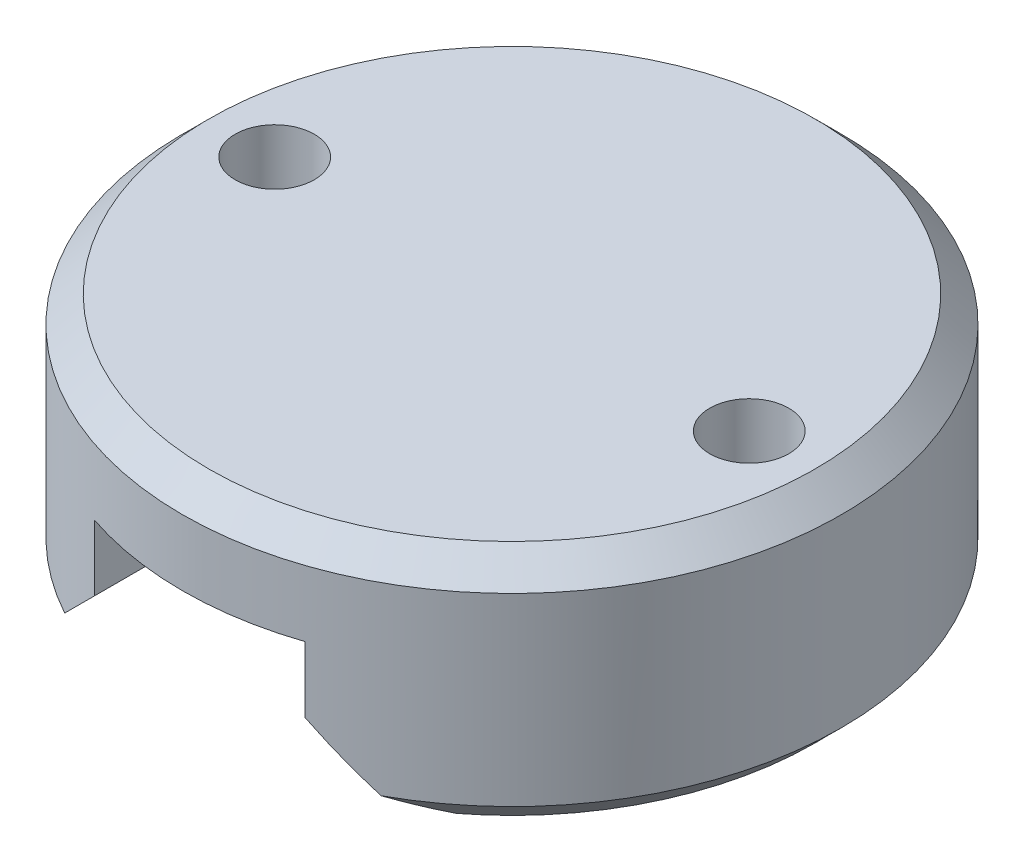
ISO-10303-21;
HEADER;
FILE_DESCRIPTION(('STEP AP214'),'2;1');
FILE_NAME('part.step','',(''),(''),'','','');
FILE_SCHEMA(('AUTOMOTIVE_DESIGN { 1 0 10303 214 1 1 1 1 }'));
ENDSEC;
DATA;
#1=APPLICATION_CONTEXT('core data for automotive mechanical design processes');
#2=APPLICATION_PROTOCOL_DEFINITION('international standard','automotive_design',2000,#1);
#3=PRODUCT_CONTEXT('',#1,'mechanical');
#4=PRODUCT('Part','Part','',(#3));
#5=PRODUCT_RELATED_PRODUCT_CATEGORY('part','',(#4));
#6=PRODUCT_DEFINITION_FORMATION('','',#4);
#7=PRODUCT_DEFINITION_CONTEXT('part definition',#1,'design');
#8=PRODUCT_DEFINITION('design','',#6,#7);
#9=PRODUCT_DEFINITION_SHAPE('','',#8);
#10=(LENGTH_UNIT() NAMED_UNIT(*) SI_UNIT(.MILLI.,.METRE.));
#11=(NAMED_UNIT(*) PLANE_ANGLE_UNIT() SI_UNIT($,.RADIAN.));
#12=(NAMED_UNIT(*) SI_UNIT($,.STERADIAN.) SOLID_ANGLE_UNIT());
#13=UNCERTAINTY_MEASURE_WITH_UNIT(LENGTH_MEASURE(1.E-05),#10,'distance_accuracy_value','');
#14=(GEOMETRIC_REPRESENTATION_CONTEXT(3) GLOBAL_UNCERTAINTY_ASSIGNED_CONTEXT((#13)) GLOBAL_UNIT_ASSIGNED_CONTEXT((#10,
#11,#12)) REPRESENTATION_CONTEXT('',''));
#15=CARTESIAN_POINT('',(0.,0.,0.));
#16=DIRECTION('',(0.,0.,1.));
#17=DIRECTION('',(1.,0.,0.));
#18=AXIS2_PLACEMENT_3D('',#15,#16,#17);
#19=CARTESIAN_POINT('',(0.,0.,0.));
#20=DIRECTION('',(0.,1.,0.));
#21=DIRECTION('',(0.,0.,1.));
#22=AXIS2_PLACEMENT_3D('',#19,#20,#21);
#23=PLANE('',#22);
#24=CARTESIAN_POINT('',(18.,0.,0.));
#25=DIRECTION('',(0.,1.,0.));
#26=DIRECTION('',(0.,0.,1.));
#27=AXIS2_PLACEMENT_3D('',#24,#25,#26);
#28=CIRCLE('',#27,3.);
#29=CARTESIAN_POINT('',(18.,0.,3.));
#30=VERTEX_POINT('',#29);
#31=EDGE_CURVE('E530',#30,#30,#28,.T.);
#32=ORIENTED_EDGE('',*,*,#31,.T.);
#33=EDGE_LOOP('',(#32));
#34=FACE_BOUND('',#33,.T.);
#35=CARTESIAN_POINT('',(0.,0.,0.));
#36=DIRECTION('',(0.,1.,0.));
#37=DIRECTION('',(0.,0.,1.));
#38=AXIS2_PLACEMENT_3D('',#35,#36,#37);
#39=CIRCLE('',#38,23.);
#40=CARTESIAN_POINT('',(14.,0.,-18.2482875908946));
#41=VERTEX_POINT('',#40);
#42=CARTESIAN_POINT('',(14.,0.,18.2482875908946));
#43=VERTEX_POINT('',#42);
#44=EDGE_CURVE('E461',#41,#43,#39,.F.);
#45=ORIENTED_EDGE('',*,*,#44,.T.);
#46=DIRECTION('',(0.,0.,-1.));
#47=VECTOR('',#46,1.);
#48=CARTESIAN_POINT('',(14.,0.,0.));
#49=LINE('',#48,#47);
#50=EDGE_CURVE('E382',#43,#41,#49,.T.);
#51=ORIENTED_EDGE('',*,*,#50,.T.);
#52=EDGE_LOOP('',(#45,#51));
#53=FACE_BOUND('',#52,.T.);
#54=ADVANCED_FACE('F361',(#34,#53),#23,.F.);
#55=CARTESIAN_POINT('',(0.,2.00000000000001,0.));
#56=DIRECTION('',(0.,1.,0.));
#57=DIRECTION('',(0.,0.,1.));
#58=AXIS2_PLACEMENT_3D('',#55,#56,#57);
#59=CONICAL_SURFACE('',#58,25.,0.78539816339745);
#60=CARTESIAN_POINT('',(0.,2.00000000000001,0.));
#61=DIRECTION('',(0.,1.,0.));
#62=DIRECTION('',(0.,0.,1.));
#63=AXIS2_PLACEMENT_3D('',#60,#61,#62);
#64=CIRCLE('',#63,25.);
#65=CARTESIAN_POINT('',(12.,2.00000000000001,21.9317121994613));
#66=VERTEX_POINT('',#65);
#67=CARTESIAN_POINT('',(12.,2.00000000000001,-21.9317121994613));
#68=VERTEX_POINT('',#67);
#69=EDGE_CURVE('E537',#66,#68,#64,.T.);
#70=ORIENTED_EDGE('',*,*,#69,.F.);
#71=CARTESIAN_POINT('',(12.,2.00000000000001,21.9317121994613));
#72=CARTESIAN_POINT('',(12.1758923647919,1.82410763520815,21.634966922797));
#73=CARTESIAN_POINT('',(12.3496957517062,1.65030424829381,21.3357336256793));
#74=CARTESIAN_POINT('',(12.6927316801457,1.30726831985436,20.7323152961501));
#75=CARTESIAN_POINT('',(12.8619664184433,1.13803358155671,20.428132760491));
#76=CARTESIAN_POINT('',(13.1956539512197,0.804346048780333,19.814533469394));
#77=CARTESIAN_POINT('',(13.3601064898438,0.639893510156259,19.5051164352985));
#78=CARTESIAN_POINT('',(13.6839552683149,0.316044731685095,18.8808036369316));
#79=CARTESIAN_POINT('',(13.8433489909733,0.156651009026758,18.565905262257));
#80=CARTESIAN_POINT('',(14.,0.,18.2482875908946));
#81=B_SPLINE_CURVE_WITH_KNOTS('',3,(#71,#72,#73,#74,#75,#76,#77,#78,#79,#80),.UNSPECIFIED.,.F.,
.F.,(4,2,2,2,4),(0.,1.1616329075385,2.32269693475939,3.4838229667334,4.64551797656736),.UNSPECIFIED.);
#82=EDGE_CURVE('E376',#66,#43,#81,.T.);
#83=ORIENTED_EDGE('',*,*,#82,.T.);
#84=ORIENTED_EDGE('',*,*,#44,.F.);
#85=CARTESIAN_POINT('',(14.,0.,-18.2482875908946));
#86=CARTESIAN_POINT('',(13.8433489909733,0.156651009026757,-18.565905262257));
#87=CARTESIAN_POINT('',(13.6839552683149,0.316044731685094,-18.8808036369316));
#88=CARTESIAN_POINT('',(13.3601064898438,0.639893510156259,-19.5051164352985));
#89=CARTESIAN_POINT('',(13.1956539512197,0.804346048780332,-19.814533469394));
#90=CARTESIAN_POINT('',(12.8619664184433,1.13803358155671,-20.428132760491));
#91=CARTESIAN_POINT('',(12.6927316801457,1.30726831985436,-20.7323152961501));
#92=CARTESIAN_POINT('',(12.3496957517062,1.65030424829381,-21.3357336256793));
#93=CARTESIAN_POINT('',(12.1758923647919,1.82410763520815,-21.634966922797));
#94=CARTESIAN_POINT('',(12.,2.00000000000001,-21.9317121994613));
#95=B_SPLINE_CURVE_WITH_KNOTS('',3,(#85,#86,#87,#88,#89,#90,#91,#92,#93,#94),.UNSPECIFIED.,.F.,
.F.,(4,2,2,2,4),(0.,1.16169500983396,2.32282104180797,3.48388506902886,4.64551797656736),.UNSPECIFIED.);
#96=EDGE_CURVE('E555',#41,#68,#95,.T.);
#97=ORIENTED_EDGE('',*,*,#96,.T.);
#98=EDGE_LOOP('',(#70,#83,#84,#97));
#99=FACE_BOUND('',#98,.T.);
#100=ADVANCED_FACE('F498',(#99),#59,.T.);
#101=CARTESIAN_POINT('',(0.,18.,0.));
#102=DIRECTION('',(0.,-1.,0.));
#103=DIRECTION('',(0.,0.,-1.));
#104=AXIS2_PLACEMENT_3D('',#101,#102,#103);
#105=CYLINDRICAL_SURFACE('',#104,25.);
#106=CARTESIAN_POINT('',(0.,16.,0.));
#107=DIRECTION('',(0.,1.,0.));
#108=DIRECTION('',(0.,0.,1.));
#109=AXIS2_PLACEMENT_3D('',#106,#107,#108);
#110=CIRCLE('',#109,25.);
#111=CARTESIAN_POINT('',(0.,16.,25.));
#112=VERTEX_POINT('',#111);
#113=EDGE_CURVE('E13',#112,#112,#110,.F.);
#114=ORIENTED_EDGE('',*,*,#113,.T.);
#115=EDGE_LOOP('',(#114));
#116=FACE_BOUND('',#115,.T.);
#117=CARTESIAN_POINT('',(-12.,2.00000000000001,-21.9317121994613));
#118=VERTEX_POINT('',#117);
#119=CARTESIAN_POINT('',(-12.,2.00000000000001,21.9317121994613));
#120=VERTEX_POINT('',#119);
#121=EDGE_CURVE('E536',#118,#120,#64,.T.);
#122=ORIENTED_EDGE('',*,*,#121,.T.);
#123=CARTESIAN_POINT('',(0.,14.,0.));
#124=DIRECTION('',(-0.707106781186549,0.707106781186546,0.));
#125=DIRECTION('',(-0.707106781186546,-0.707106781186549,0.));
#126=AXIS2_PLACEMENT_3D('',#123,#124,#125);
#127=ELLIPSE('',#126,35.3553390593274,25.);
#128=CARTESIAN_POINT('',(-8.,6.00000000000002,23.685438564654));
#129=VERTEX_POINT('',#128);
#130=EDGE_CURVE('E542',#120,#129,#127,.T.);
#131=ORIENTED_EDGE('',*,*,#130,.T.);
#132=DIRECTION('',(0.,-1.,0.));
#133=VECTOR('',#132,1.);
#134=CARTESIAN_POINT('',(-8.,18.,23.685438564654));
#135=LINE('',#134,#133);
#136=CARTESIAN_POINT('',(-8.,11.,23.685438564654));
#137=VERTEX_POINT('',#136);
#138=EDGE_CURVE('E438',#129,#137,#135,.F.);
#139=ORIENTED_EDGE('',*,*,#138,.T.);
#140=CARTESIAN_POINT('',(0.,11.,0.));
#141=DIRECTION('',(0.,1.,0.));
#142=DIRECTION('',(-1.,0.,0.));
#143=AXIS2_PLACEMENT_3D('',#140,#141,#142);
#144=CIRCLE('',#143,25.);
#145=CARTESIAN_POINT('',(8.,11.,23.685438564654));
#146=VERTEX_POINT('',#145);
#147=EDGE_CURVE('E448',#137,#146,#144,.T.);
#148=ORIENTED_EDGE('',*,*,#147,.T.);
#149=DIRECTION('',(0.,-1.,0.));
#150=VECTOR('',#149,1.);
#151=CARTESIAN_POINT('',(8.,18.,23.685438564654));
#152=LINE('',#151,#150);
#153=CARTESIAN_POINT('',(8.,6.,23.685438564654));
#154=VERTEX_POINT('',#153);
#155=EDGE_CURVE('E437',#146,#154,#152,.T.);
#156=ORIENTED_EDGE('',*,*,#155,.T.);
#157=CARTESIAN_POINT('',(0.,14.,0.));
#158=DIRECTION('',(0.707106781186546,0.707106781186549,0.));
#159=DIRECTION('',(0.707106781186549,-0.707106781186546,0.));
#160=AXIS2_PLACEMENT_3D('',#157,#158,#159);
#161=ELLIPSE('',#160,35.3553390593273,25.);
#162=EDGE_CURVE('E549',#154,#66,#161,.T.);
#163=ORIENTED_EDGE('',*,*,#162,.T.);
#164=ORIENTED_EDGE('',*,*,#69,.T.);
#165=CARTESIAN_POINT('',(0.,14.,0.));
#166=DIRECTION('',(0.707106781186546,0.707106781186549,0.));
#167=DIRECTION('',(0.707106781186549,-0.707106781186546,0.));
#168=AXIS2_PLACEMENT_3D('',#165,#166,#167);
#169=ELLIPSE('',#168,35.3553390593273,25.);
#170=CARTESIAN_POINT('',(8.,6.,-23.685438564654));
#171=VERTEX_POINT('',#170);
#172=EDGE_CURVE('E628',#68,#171,#169,.T.);
#173=ORIENTED_EDGE('',*,*,#172,.T.);
#174=DIRECTION('',(0.,-1.,0.));
#175=VECTOR('',#174,1.);
#176=CARTESIAN_POINT('',(8.,18.,-23.685438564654));
#177=LINE('',#176,#175);
#178=CARTESIAN_POINT('',(8.,11.,-23.685438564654));
#179=VERTEX_POINT('',#178);
#180=EDGE_CURVE('E453',#171,#179,#177,.F.);
#181=ORIENTED_EDGE('',*,*,#180,.T.);
#182=CARTESIAN_POINT('',(-8.,11.,-23.685438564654));
#183=VERTEX_POINT('',#182);
#184=EDGE_CURVE('E445',#179,#183,#144,.T.);
#185=ORIENTED_EDGE('',*,*,#184,.T.);
#186=DIRECTION('',(0.,-1.,0.));
#187=VECTOR('',#186,1.);
#188=CARTESIAN_POINT('',(-8.,18.,-23.685438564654));
#189=LINE('',#188,#187);
#190=CARTESIAN_POINT('',(-8.,6.00000000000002,-23.685438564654));
#191=VERTEX_POINT('',#190);
#192=EDGE_CURVE('E427',#183,#191,#189,.T.);
#193=ORIENTED_EDGE('',*,*,#192,.T.);
#194=CARTESIAN_POINT('',(0.,14.,0.));
#195=DIRECTION('',(-0.707106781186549,0.707106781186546,0.));
#196=DIRECTION('',(-0.707106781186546,-0.707106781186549,0.));
#197=AXIS2_PLACEMENT_3D('',#194,#195,#196);
#198=ELLIPSE('',#197,35.3553390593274,25.);
#199=EDGE_CURVE('E543',#191,#118,#198,.T.);
#200=ORIENTED_EDGE('',*,*,#199,.T.);
#201=EDGE_LOOP('',(#122,#131,#139,#148,#156,#163,#164,#173,#181,#185,#193,#200));
#202=FACE_BOUND('',#201,.T.);
#203=ADVANCED_FACE('F363',(#116,#202),#105,.T.);
#204=CARTESIAN_POINT('',(0.,18.,0.));
#205=DIRECTION('',(0.,1.,0.));
#206=DIRECTION('',(0.,0.,1.));
#207=AXIS2_PLACEMENT_3D('',#204,#205,#206);
#208=PLANE('',#207);
#209=CARTESIAN_POINT('',(0.,18.,0.));
#210=DIRECTION('',(0.,1.,0.));
#211=DIRECTION('',(0.,0.,1.));
#212=AXIS2_PLACEMENT_3D('',#209,#210,#211);
#213=CIRCLE('',#212,23.);
#214=CARTESIAN_POINT('',(0.,18.,23.));
#215=VERTEX_POINT('',#214);
#216=EDGE_CURVE('E369',#215,#215,#213,.T.);
#217=ORIENTED_EDGE('',*,*,#216,.T.);
#218=EDGE_LOOP('',(#217));
#219=FACE_BOUND('',#218,.T.);
#220=CARTESIAN_POINT('',(-18.,18.,0.));
#221=DIRECTION('',(0.,1.,0.));
#222=DIRECTION('',(0.,0.,1.));
#223=AXIS2_PLACEMENT_3D('',#220,#221,#222);
#224=CIRCLE('',#223,3.);
#225=CARTESIAN_POINT('',(-18.,18.,3.));
#226=VERTEX_POINT('',#225);
#227=EDGE_CURVE('E527',#226,#226,#224,.T.);
#228=ORIENTED_EDGE('',*,*,#227,.F.);
#229=EDGE_LOOP('',(#228));
#230=FACE_BOUND('',#229,.T.);
#231=CARTESIAN_POINT('',(18.,18.,0.));
#232=DIRECTION('',(0.,1.,0.));
#233=DIRECTION('',(0.,0.,1.));
#234=AXIS2_PLACEMENT_3D('',#231,#232,#233);
#235=CIRCLE('',#234,3.);
#236=CARTESIAN_POINT('',(18.,18.,3.));
#237=VERTEX_POINT('',#236);
#238=EDGE_CURVE('E526',#237,#237,#235,.T.);
#239=ORIENTED_EDGE('',*,*,#238,.F.);
#240=EDGE_LOOP('',(#239));
#241=FACE_BOUND('',#240,.T.);
#242=ADVANCED_FACE('F509',(#219,#230,#241),#208,.T.);
#243=CARTESIAN_POINT('',(-14.,0.,18.2482875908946));
#244=VERTEX_POINT('',#243);
#245=CARTESIAN_POINT('',(-14.,0.,-18.2482875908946));
#246=VERTEX_POINT('',#245);
#247=EDGE_CURVE('E459',#244,#246,#39,.F.);
#248=ORIENTED_EDGE('',*,*,#247,.T.);
#249=DIRECTION('',(0.,0.,1.));
#250=VECTOR('',#249,1.);
#251=CARTESIAN_POINT('',(-14.,0.,0.));
#252=LINE('',#251,#250);
#253=EDGE_CURVE('E454',#246,#244,#252,.T.);
#254=ORIENTED_EDGE('',*,*,#253,.T.);
#255=EDGE_LOOP('',(#248,#254));
#256=FACE_BOUND('',#255,.T.);
#257=CARTESIAN_POINT('',(-18.,0.,0.));
#258=DIRECTION('',(0.,1.,0.));
#259=DIRECTION('',(0.,0.,1.));
#260=AXIS2_PLACEMENT_3D('',#257,#258,#259);
#261=CIRCLE('',#260,3.);
#262=CARTESIAN_POINT('',(-18.,0.,3.));
#263=VERTEX_POINT('',#262);
#264=EDGE_CURVE('E524',#263,#263,#261,.T.);
#265=ORIENTED_EDGE('',*,*,#264,.T.);
#266=EDGE_LOOP('',(#265));
#267=FACE_BOUND('',#266,.T.);
#268=ADVANCED_FACE('F501',(#256,#267),#23,.F.);
#269=CARTESIAN_POINT('',(18.,0.,0.));
#270=DIRECTION('',(0.,1.,0.));
#271=DIRECTION('',(0.,0.,1.));
#272=AXIS2_PLACEMENT_3D('',#269,#270,#271);
#273=CYLINDRICAL_SURFACE('',#272,3.);
#274=ORIENTED_EDGE('',*,*,#31,.F.);
#275=EDGE_LOOP('',(#274));
#276=FACE_BOUND('',#275,.T.);
#277=ORIENTED_EDGE('',*,*,#238,.T.);
#278=EDGE_LOOP('',(#277));
#279=FACE_BOUND('',#278,.T.);
#280=ADVANCED_FACE('F508',(#276,#279),#273,.F.);
#281=CARTESIAN_POINT('',(-18.,0.,0.));
#282=DIRECTION('',(0.,1.,0.));
#283=DIRECTION('',(0.,0.,1.));
#284=AXIS2_PLACEMENT_3D('',#281,#282,#283);
#285=CYLINDRICAL_SURFACE('',#284,3.);
#286=ORIENTED_EDGE('',*,*,#264,.F.);
#287=EDGE_LOOP('',(#286));
#288=FACE_BOUND('',#287,.T.);
#289=ORIENTED_EDGE('',*,*,#227,.T.);
#290=EDGE_LOOP('',(#289));
#291=FACE_BOUND('',#290,.T.);
#292=ADVANCED_FACE('F515',(#288,#291),#285,.F.);
#293=ORIENTED_EDGE('',*,*,#247,.F.);
#294=CARTESIAN_POINT('',(-14.,0.,18.2482875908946));
#295=CARTESIAN_POINT('',(-13.8433489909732,0.156651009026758,18.5659052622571));
#296=CARTESIAN_POINT('',(-13.6839552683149,0.316044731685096,18.8808036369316));
#297=CARTESIAN_POINT('',(-13.3601064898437,0.63989351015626,19.5051164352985));
#298=CARTESIAN_POINT('',(-13.1956539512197,0.804346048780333,19.814533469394));
#299=CARTESIAN_POINT('',(-12.8619664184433,1.13803358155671,20.428132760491));
#300=CARTESIAN_POINT('',(-12.6927316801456,1.30726831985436,20.7323152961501));
#301=CARTESIAN_POINT('',(-12.3496957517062,1.65030424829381,21.3357336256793));
#302=CARTESIAN_POINT('',(-12.1758923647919,1.82410763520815,21.634966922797));
#303=CARTESIAN_POINT('',(-12.,2.00000000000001,21.9317121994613));
#304=B_SPLINE_CURVE_WITH_KNOTS('',3,(#294,#295,#296,#297,#298,#299,#300,#301,#302,#303),
.UNSPECIFIED.,.F.,.F.,(4,2,2,2,4),(0.,1.16169500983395,2.32282104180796,3.48388506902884,
4.64551797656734),.UNSPECIFIED.);
#305=EDGE_CURVE('E470',#244,#120,#304,.T.);
#306=ORIENTED_EDGE('',*,*,#305,.T.);
#307=ORIENTED_EDGE('',*,*,#121,.F.);
#308=CARTESIAN_POINT('',(-12.,2.00000000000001,-21.9317121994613));
#309=CARTESIAN_POINT('',(-12.1758923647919,1.82410763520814,-21.634966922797));
#310=CARTESIAN_POINT('',(-12.3496957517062,1.65030424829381,-21.3357336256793));
#311=CARTESIAN_POINT('',(-12.6927316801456,1.30726831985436,-20.7323152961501));
#312=CARTESIAN_POINT('',(-12.8619664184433,1.13803358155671,-20.428132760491));
#313=CARTESIAN_POINT('',(-13.1956539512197,0.804346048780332,-19.814533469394));
#314=CARTESIAN_POINT('',(-13.3601064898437,0.639893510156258,-19.5051164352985));
#315=CARTESIAN_POINT('',(-13.6839552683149,0.316044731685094,-18.8808036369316));
#316=CARTESIAN_POINT('',(-13.8433489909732,0.156651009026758,-18.5659052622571));
#317=CARTESIAN_POINT('',(-14.,0.,-18.2482875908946));
#318=B_SPLINE_CURVE_WITH_KNOTS('',3,(#308,#309,#310,#311,#312,#313,#314,#315,#316,#317),
.UNSPECIFIED.,.F.,.F.,(4,2,2,2,4),(0.,1.16163290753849,2.32269693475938,3.48382296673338,
4.64551797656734),.UNSPECIFIED.);
#319=EDGE_CURVE('E457',#118,#246,#318,.T.);
#320=ORIENTED_EDGE('',*,*,#319,.T.);
#321=EDGE_LOOP('',(#293,#306,#307,#320));
#322=FACE_BOUND('',#321,.T.);
#323=ADVANCED_FACE('F475',(#322),#59,.T.);
#324=CARTESIAN_POINT('',(8.,11.,-25.));
#325=DIRECTION('',(0.,1.,0.));
#326=DIRECTION('',(-1.,0.,0.));
#327=AXIS2_PLACEMENT_3D('',#324,#325,#326);
#328=PLANE('',#327);
#329=DIRECTION('',(0.,0.,1.));
#330=VECTOR('',#329,1.);
#331=CARTESIAN_POINT('',(-8.,11.,-25.));
#332=LINE('',#331,#330);
#333=EDGE_CURVE('E431',#183,#137,#332,.T.);
#334=ORIENTED_EDGE('',*,*,#333,.F.);
#335=ORIENTED_EDGE('',*,*,#184,.F.);
#336=DIRECTION('',(0.,0.,1.));
#337=VECTOR('',#336,1.);
#338=CARTESIAN_POINT('',(8.,11.,-25.));
#339=LINE('',#338,#337);
#340=EDGE_CURVE('E449',#179,#146,#339,.T.);
#341=ORIENTED_EDGE('',*,*,#340,.T.);
#342=ORIENTED_EDGE('',*,*,#147,.F.);
#343=EDGE_LOOP('',(#334,#335,#341,#342));
#344=FACE_BOUND('',#343,.T.);
#345=ADVANCED_FACE('F443',(#344),#328,.F.);
#346=CARTESIAN_POINT('',(8.,0.,-25.));
#347=DIRECTION('',(1.,0.,0.));
#348=DIRECTION('',(0.,0.,-1.));
#349=AXIS2_PLACEMENT_3D('',#346,#347,#348);
#350=PLANE('',#349);
#351=ORIENTED_EDGE('',*,*,#180,.F.);
#352=DIRECTION('',(0.,0.,1.));
#353=VECTOR('',#352,1.);
#354=CARTESIAN_POINT('',(8.,6.,-25.));
#355=LINE('',#354,#353);
#356=EDGE_CURVE('E547',#171,#154,#355,.T.);
#357=ORIENTED_EDGE('',*,*,#356,.T.);
#358=ORIENTED_EDGE('',*,*,#155,.F.);
#359=ORIENTED_EDGE('',*,*,#340,.F.);
#360=EDGE_LOOP('',(#351,#357,#358,#359));
#361=FACE_BOUND('',#360,.T.);
#362=ADVANCED_FACE('F491',(#361),#350,.F.);
#363=CARTESIAN_POINT('',(-8.,0.,-25.));
#364=DIRECTION('',(-1.,0.,0.));
#365=DIRECTION('',(0.,0.,1.));
#366=AXIS2_PLACEMENT_3D('',#363,#364,#365);
#367=PLANE('',#366);
#368=ORIENTED_EDGE('',*,*,#138,.F.);
#369=DIRECTION('',(0.,0.,-1.));
#370=VECTOR('',#369,1.);
#371=CARTESIAN_POINT('',(-8.,6.00000000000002,-25.));
#372=LINE('',#371,#370);
#373=EDGE_CURVE('E433',#129,#191,#372,.T.);
#374=ORIENTED_EDGE('',*,*,#373,.T.);
#375=ORIENTED_EDGE('',*,*,#192,.F.);
#376=ORIENTED_EDGE('',*,*,#333,.T.);
#377=EDGE_LOOP('',(#368,#374,#375,#376));
#378=FACE_BOUND('',#377,.T.);
#379=ADVANCED_FACE('F430',(#378),#367,.F.);
#380=CARTESIAN_POINT('',(-14.,0.,0.));
#381=DIRECTION('',(-0.707106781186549,0.707106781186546,0.));
#382=DIRECTION('',(-0.707106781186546,-0.707106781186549,0.));
#383=AXIS2_PLACEMENT_3D('',#380,#381,#382);
#384=PLANE('',#383);
#385=ORIENTED_EDGE('',*,*,#199,.F.);
#386=ORIENTED_EDGE('',*,*,#373,.F.);
#387=ORIENTED_EDGE('',*,*,#130,.F.);
#388=ORIENTED_EDGE('',*,*,#305,.F.);
#389=ORIENTED_EDGE('',*,*,#253,.F.);
#390=ORIENTED_EDGE('',*,*,#319,.F.);
#391=EDGE_LOOP('',(#385,#386,#387,#388,#389,#390));
#392=FACE_BOUND('',#391,.T.);
#393=ADVANCED_FACE('F479',(#392),#384,.F.);
#394=CARTESIAN_POINT('',(8.,6.,-25.));
#395=DIRECTION('',(0.707106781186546,0.707106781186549,0.));
#396=DIRECTION('',(-0.707106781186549,0.707106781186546,0.));
#397=AXIS2_PLACEMENT_3D('',#394,#395,#396);
#398=PLANE('',#397);
#399=ORIENTED_EDGE('',*,*,#96,.F.);
#400=ORIENTED_EDGE('',*,*,#50,.F.);
#401=ORIENTED_EDGE('',*,*,#82,.F.);
#402=ORIENTED_EDGE('',*,*,#162,.F.);
#403=ORIENTED_EDGE('',*,*,#356,.F.);
#404=ORIENTED_EDGE('',*,*,#172,.F.);
#405=EDGE_LOOP('',(#399,#400,#401,#402,#403,#404));
#406=FACE_BOUND('',#405,.T.);
#407=ADVANCED_FACE('F484',(#406),#398,.F.);
#408=CARTESIAN_POINT('',(0.,18.,0.));
#409=DIRECTION('',(0.,-1.,0.));
#410=DIRECTION('',(0.,0.,-1.));
#411=AXIS2_PLACEMENT_3D('',#408,#409,#410);
#412=CONICAL_SURFACE('',#411,23.,0.785398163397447);
#413=ORIENTED_EDGE('',*,*,#113,.F.);
#414=EDGE_LOOP('',(#413));
#415=FACE_BOUND('',#414,.T.);
#416=ORIENTED_EDGE('',*,*,#216,.F.);
#417=EDGE_LOOP('',(#416));
#418=FACE_BOUND('',#417,.T.);
#419=ADVANCED_FACE('F568',(#415,#418),#412,.T.);
#420=CLOSED_SHELL('',(#54,#100,#203,#242,#268,#280,#292,#323,#345,#362,#379,#393,#407,#419));
#421=MANIFOLD_SOLID_BREP('B2',#420);
#422=ADVANCED_BREP_SHAPE_REPRESENTATION('',(#18,#421),#14);
#423=SHAPE_DEFINITION_REPRESENTATION(#9,#422);
ENDSEC;
END-ISO-10303-21;
